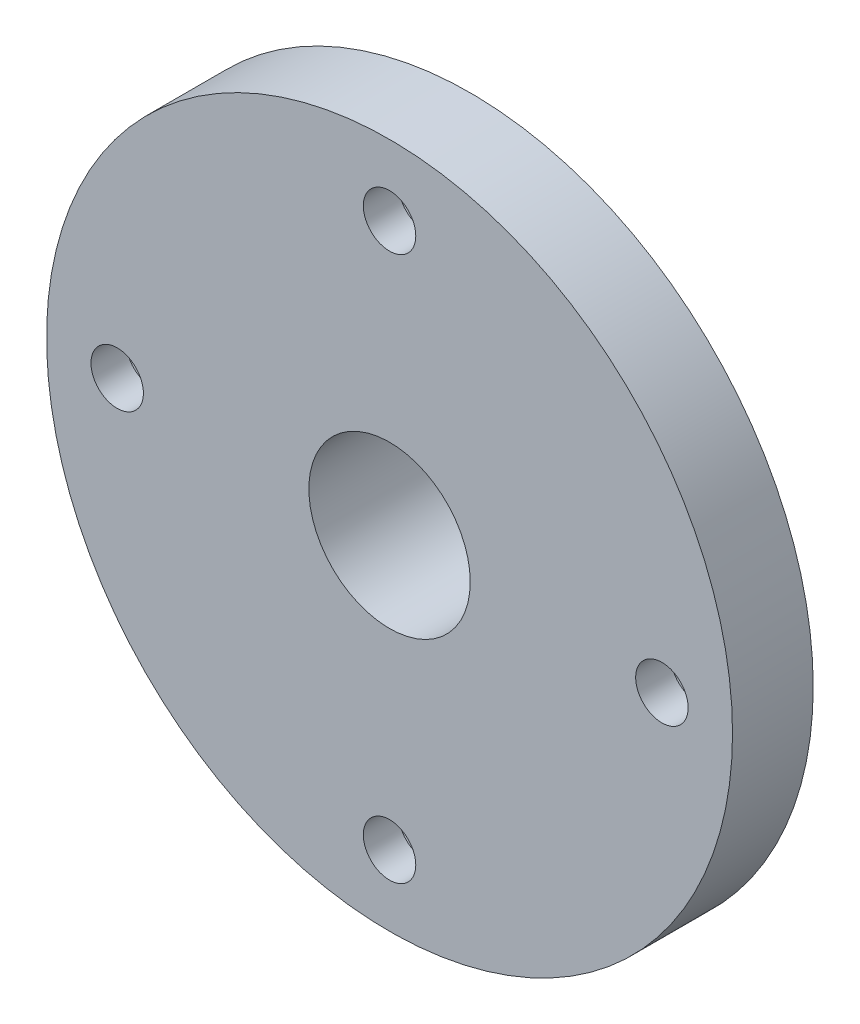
from build123d import *

# Parameters (mm, degrees)
CONG_2_R                = 5
BOSS_EXTRU_3_START      = 5
ESQUISSE4_R             = 11
ESQUISSE4_R_2           = 8
BOSS_EXTRU_3_DEPTH      = 5
ESQUISSE5_R             = 2.6
ENL_V_MAT_EXTRU_1_DEPTH = 54.301032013
ESQUISSE6_R             = 5
ENL_V_MAT_EXTRU_2_DEPTH = 52.886896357


with BuildPart() as part:
    # Esquisse3 → R_volution1 (revolve)
    with BuildSketch(Plane(origin=(0, 0, 0), x_dir=(1, 0, 0), z_dir=(0, 1, 0))):
        Polygon((8, 18), (12.5, 18), (12.5, 11), (34, 8), (34, 0), (8, 0), align=None)
    revolve(axis=Axis((0, 0, 0), (0, 0, -1)))

    # Cong_2
    cong_2_edges = [part.edges().sort_by_distance(p)[0] for p in [
        (-12.5, 0, -11),
    ]]
    fillet(cong_2_edges, radius=CONG_2_R)

    # Esquisse4 → Boss.-Extru.3 (add)
    with BuildSketch(Plane(origin=(0, 0, -18), x_dir=(-1, 0, 0), z_dir=(0, 0, -1)).offset(BOSS_EXTRU_3_START)):
        Circle(ESQUISSE4_R)
        with Locations(Location((0, 0, 0), (0, 0, 180))):
            Circle(ESQUISSE4_R_2, mode=Mode.SUBTRACT)
    extrude(amount=-BOSS_EXTRU_3_DEPTH)

    # Esquisse5 → Enl_v. mat.-Extru.1 (cut, through all)
    with BuildSketch(Plane.XY):
        with Locations((-27, 0)):
            Circle(ESQUISSE5_R)
        with Locations((0, 27)):
            Circle(ESQUISSE5_R)
        with Locations((27, 0)):
            Circle(ESQUISSE5_R)
        with Locations((0, -27)):
            Circle(ESQUISSE5_R)
    extrude(amount=-ENL_V_MAT_EXTRU_1_DEPTH, mode=Mode.SUBTRACT)

    # Esquisse6 → Enl_v. mat.-Extru.2 (cut, through all)
    with BuildSketch(Plane.XY.offset(-3.5)):
        with Locations((-27, 0)):
            Circle(ESQUISSE6_R)
        with Locations((0, 27)):
            Circle(ESQUISSE6_R)
        with Locations((27, 0)):
            Circle(ESQUISSE6_R)
        with Locations((0, -27)):
            Circle(ESQUISSE6_R)
    extrude(amount=-ENL_V_MAT_EXTRU_2_DEPTH, mode=Mode.SUBTRACT)


solid = part.part
